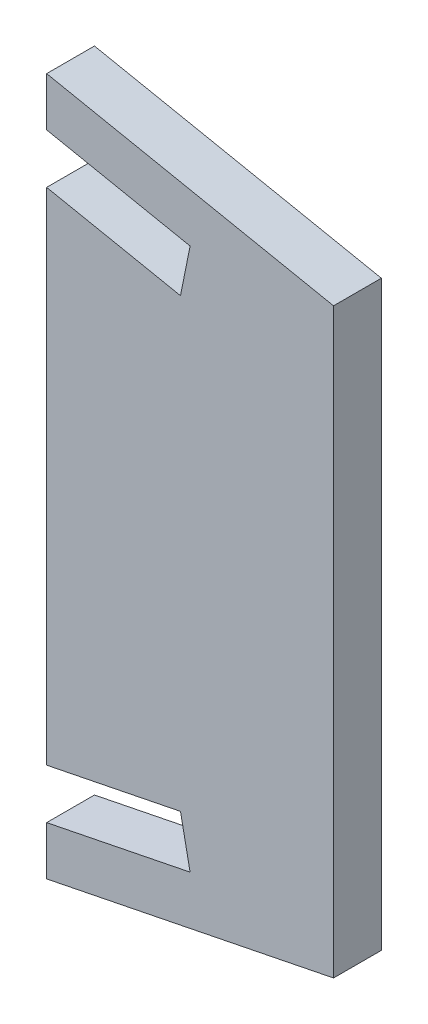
from build123d import *

# Parameters (mm, degrees)
ESQUISSE1_W             = 60
ESQUISSE1_H             = 150
BOSS_EXTRU_1_DEPTH      = 10
ENL_V_MAT_EXTRU_1_DEPTH = 10
ENL_V_MAT_EXTRU_2_DEPTH = 10


with BuildPart() as part:
    # Esquisse1 → Boss.-Extru.1 (new body)
    with BuildSketch(Plane.XY):
        with Locations((-30, 75)):
            Rectangle(ESQUISSE1_W, ESQUISSE1_H)
    extrude(amount=BOSS_EXTRU_1_DEPTH)

    # Esquisse2 → Enl_v. mat.-Extru.1 (cut)
    with BuildSketch(Plane.XY.offset(10)):
        Polygon((-60, 137.727439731), (-30, 131.700171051), (-32.009123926, 121.7), (-60, 127.323617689), align=None)
        Polygon((-60, 22.676382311), (-60, 12.272560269), (-30, 18.299828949), (-32.009123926, 28.3), align=None)
    extrude(amount=-ENL_V_MAT_EXTRU_1_DEPTH, mode=Mode.SUBTRACT)

    # Esquisse3 → Enl_v. mat.-Extru.2 (cut)
    with BuildSketch(Plane.XY.offset(10)):
        Polygon((-70.316786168, 150), (0, 135.872727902), (0, 150), align=None)
        Polygon((0, 0), (-70.316786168, 0), (0, 14.127272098), align=None)
    extrude(amount=-ENL_V_MAT_EXTRU_2_DEPTH, mode=Mode.SUBTRACT)


solid = part.part
